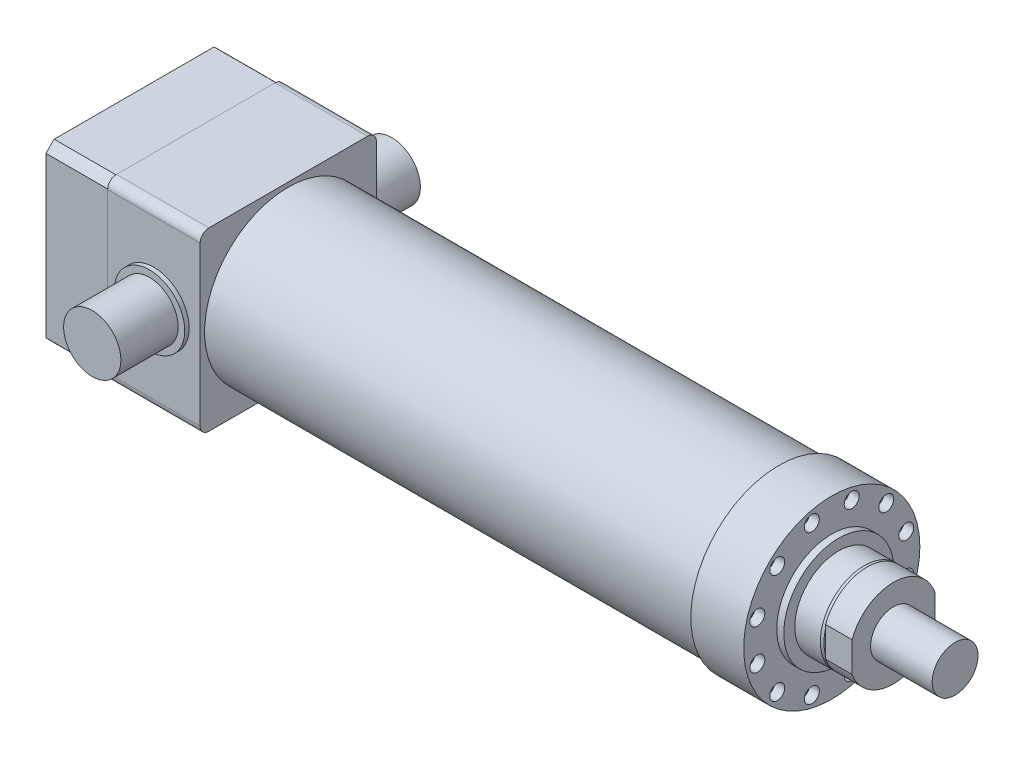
from build123d import *

# Parameters (mm, degrees)
SKETCH_1_R          = 95
SKETCH_1_R_2        = 80
EXTRUDE_1_DEPTH     = 557
SKETCH_2_R          = 100
EXTRUDE_2_DEPTH     = 60
SKETCH_3_R          = 62.5
EXTRUDE_3_DEPTH     = 8
SKETCH_4_R          = 8.5
CUT_EXTRUDE_3_DEPTH = 11
SKETCH_6_R          = 50
EXTRUDE_4_DEPTH     = 32
CHAMFER_1_SIZE      = 3
CHAMFER_1_SIZE2     = 1.091910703
EXTRUDE_5_DEPTH     = 30
SKETCH_8_R          = 26
CUT_EXTRUDE_4_DEPTH = 82
EXTRUDE_6_DEPTH     = 105
EXTRUDE_7_DEPTH     = 70
SKETCH_11_R         = 65
CUT_EXTRUDE_5_DEPTH = 30
SKETCH_12_R         = 55
CUT_EXTRUDE_6_DEPTH = 31
SKETCH_13_R         = 5
CUT_EXTRUDE_7_DEPTH = 20
SKETCH_14_R         = 32.5
EXTRUDE_8_DEPTH     = 70
EXTRUDE_START       = -270
SKETCH_14_2_R       = 32.5
EXTRUDE_9_DEPTH     = 70
SKETCH_15_R         = 40
SKETCH_15_R_2       = 32.5
EXTRUDE_10_DEPTH    = 5
EXTRUDE_START_2     = -205
SKETCH_15_2_R       = 40
SKETCH_15_2_R_2     = 32.5
EXTRUDE_11_DEPTH    = 5
SKETCH_16_R         = 26
EXTRUDE_12_DEPTH    = 70


with BuildPart() as part:
    # Sketch 1 → Extrude 1 (new body)
    with BuildSketch(Plane(origin=(0, 0, 0), x_dir=(0, 0, -1), z_dir=(1, 0, 0))):
        Circle(SKETCH_1_R)
        Circle(SKETCH_1_R_2, mode=Mode.SUBTRACT)
    extrude(amount=EXTRUDE_1_DEPTH)

    # Sketch 2 → Extrude 2 (add)
    with BuildSketch(Plane(origin=(557, 0, 0), x_dir=(0, 0, -1), z_dir=(1, 0, 0))):
        Circle(SKETCH_2_R)
    extrude(amount=EXTRUDE_2_DEPTH)

    # Sketch 3 → Extrude 3 (add)
    with BuildSketch(Plane(origin=(617, 0, 0), x_dir=(0, 0, -1), z_dir=(1, 0, 0))):
        Circle(SKETCH_3_R)
    extrude(amount=EXTRUDE_3_DEPTH)

    # Sketch 4 → Cut-Extrude 3 (cut)
    with BuildSketch(Plane(origin=(617, 0, 0), x_dir=(0, 0, -1), z_dir=(1, 0, 0))):
        with Locations((-22.646666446, 84.5185098)):
            Circle(SKETCH_4_R)
        with Locations((22.646666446, 84.5185098)):
            Circle(SKETCH_4_R)
        with Locations((61.871843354, 61.871843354)):
            Circle(SKETCH_4_R)
        with Locations((84.5185098, 22.646666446)):
            Circle(SKETCH_4_R)
        with Locations((84.5185098, -22.646666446)):
            Circle(SKETCH_4_R)
        with Locations((61.871843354, -61.871843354)):
            Circle(SKETCH_4_R)
        with Locations((22.646666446, -84.5185098)):
            Circle(SKETCH_4_R)
        with Locations((-22.646666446, -84.5185098)):
            Circle(SKETCH_4_R)
        with Locations((-61.871843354, -61.871843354)):
            Circle(SKETCH_4_R)
        with Locations((-84.5185098, -22.646666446)):
            Circle(SKETCH_4_R)
        with Locations((-84.5185098, 22.646666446)):
            Circle(SKETCH_4_R)
        with Locations((-61.871843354, 61.871843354)):
            Circle(SKETCH_4_R)
    extrude(amount=-CUT_EXTRUDE_3_DEPTH, mode=Mode.SUBTRACT)

    # Sketch 6 → Extrude 4 (add)
    with BuildSketch(Plane(origin=(625, 0, 0), x_dir=(0, 0, -1), z_dir=(1, 0, 0))):
        Circle(SKETCH_6_R)
    extrude(amount=EXTRUDE_4_DEPTH)

    # Chamfer 1
    chamfer_1_edges = [part.edges().sort_by_distance(p)[0] for p in [
        (657, 0, 50),
    ]]
    chamfer_1_side = [part.faces().sort_by_distance(p)[0] for p in [
        (641, 0, 50),
    ]]
    chamfer(chamfer_1_edges, length=CHAMFER_1_SIZE, length2=CHAMFER_1_SIZE2, reference=chamfer_1_side[0])

    # Sketch 7 → Extrude 5 (add)
    with BuildSketch(Plane(origin=(657, 0, 0), x_dir=(0, 0, -1), z_dir=(1, 0, 0))):
        with BuildLine():
            Line((-47, 17.058722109), (-47, -17.058722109))
            ThreePointArc((-47, -17.058722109), (0, -50), (47, -17.058722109))
            Line((47, -17.058722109), (47, 17.058722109))
            ThreePointArc((47, 17.058722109), (0, 50), (-47, 17.058722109))
        make_face()
    extrude(amount=EXTRUDE_5_DEPTH)

    # Sketch 8 → Cut-Extrude 4 (cut)
    with BuildSketch(Plane(origin=(687, 0, 0), x_dir=(0, 0, -1), z_dir=(1, 0, 0))):
        Circle(SKETCH_8_R)
    extrude(amount=-CUT_EXTRUDE_4_DEPTH, mode=Mode.SUBTRACT)

    # Sketch 9 → Extrude 6 (add)
    with BuildSketch(Plane.ZY):
        with BuildLine():
            Line((-90, 100), (90, 100))
            ThreePointArc((90, 100), (97.071067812, 97.071067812), (100, 90))
            Line((100, 90), (100, -90))
            ThreePointArc((100, -90), (97.071067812, -97.071067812), (90, -100))
            Line((90, -100), (-90, -100))
            ThreePointArc((-90, -100), (-97.071067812, -97.071067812), (-100, -90))
            Line((-100, -90), (-100, 90))
            ThreePointArc((-100, 90), (-97.071067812, 97.071067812), (-90, 100))
        make_face()
    extrude(amount=EXTRUDE_6_DEPTH)

    # Sketch 14 → Extrude 8 (add)
    with BuildSketch(Plane.XY.offset(100)):
        with Locations(Location((-52.5, 0, 0), (0, 0, 90))):
            Circle(SKETCH_14_R)
    extrude(amount=EXTRUDE_8_DEPTH)

    # Sketch 14_2 → Extrude 9 (add)
    with BuildSketch(Plane.XY.offset(100).offset(EXTRUDE_START)):
        with Locations(Location((-52.5, 0, 0), (0, 0, 90))):
            Circle(SKETCH_14_2_R)
    extrude(amount=EXTRUDE_9_DEPTH)

    # Sketch 15 → Extrude 10 (add)
    with BuildSketch(Plane.XY.offset(100)):
        with Locations(Location((-52.5, 0, 0), (0, 0, 90))):
            Circle(SKETCH_15_R)
        with Locations((-52.5, 0)):
            Circle(SKETCH_15_R_2, mode=Mode.SUBTRACT)
    extrude(amount=EXTRUDE_10_DEPTH)

    # Sketch 15_2 → Extrude 11 (add)
    with BuildSketch(Plane.XY.offset(100).offset(EXTRUDE_START_2)):
        with Locations(Location((-52.5, 0, 0), (0, 0, 90))):
            Circle(SKETCH_15_2_R)
        with Locations((-52.5, 0)):
            Circle(SKETCH_15_2_R_2, mode=Mode.SUBTRACT)
    extrude(amount=EXTRUDE_11_DEPTH)


with BuildPart() as body_2:
    # Sketch 10 → Extrude 7 (new body)
    with BuildSketch(Plane.ZY.offset(105)):
        with BuildLine():
            Line((-90.691785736, 100), (90.691785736, 100))
            ThreePointArc((90.691785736, 100), (95.45941546, 95.45941546), (100, 90.691785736))
            Line((100, 90.691785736), (100, -90.691785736))
            ThreePointArc((100, -90.691785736), (95.45941546, -95.45941546), (90.691785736, -100))
            Line((90.691785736, -100), (-90.691785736, -100))
            ThreePointArc((-90.691785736, -100), (-95.45941546, -95.45941546), (-100, -90.691785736))
            Line((-100, -90.691785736), (-100, 90.691785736))
            ThreePointArc((-100, 90.691785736), (-95.45941546, 95.45941546), (-90.691785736, 100))
        make_face()
    extrude(amount=EXTRUDE_7_DEPTH)

    # Sketch 11 → Cut-Extrude 5 (cut)
    with BuildSketch(Plane.ZY.offset(175)):
        Circle(SKETCH_11_R)
    extrude(amount=-CUT_EXTRUDE_5_DEPTH, mode=Mode.SUBTRACT)

    # Sketch 12 → Cut-Extrude 6 (cut)
    with BuildSketch(Plane.ZY.offset(145)):
        Circle(SKETCH_12_R)
    extrude(amount=-CUT_EXTRUDE_6_DEPTH, mode=Mode.SUBTRACT)

    # Sketch 13 → Cut-Extrude 7 (cut)
    with BuildSketch(Plane.ZY.offset(175)):
        with Locations((-58.336309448, 58.336309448)):
            Circle(SKETCH_13_R)
        with Locations((58.336309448, 58.336309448)):
            Circle(SKETCH_13_R)
        with Locations((58.336309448, -58.336309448)):
            Circle(SKETCH_13_R)
        with Locations((-58.336309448, -58.336309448)):
            Circle(SKETCH_13_R)
    extrude(amount=-CUT_EXTRUDE_7_DEPTH, mode=Mode.SUBTRACT)


with BuildPart() as body_3:
    # Sketch 16 → Extrude 12 (new body)
    with BuildSketch(Plane(origin=(687, 0, 0), x_dir=(0, 0, -1), z_dir=(1, 0, 0))):
        Circle(SKETCH_16_R)
    extrude(amount=EXTRUDE_12_DEPTH)


solid = Compound([part.part, body_2.part, body_3.part])
